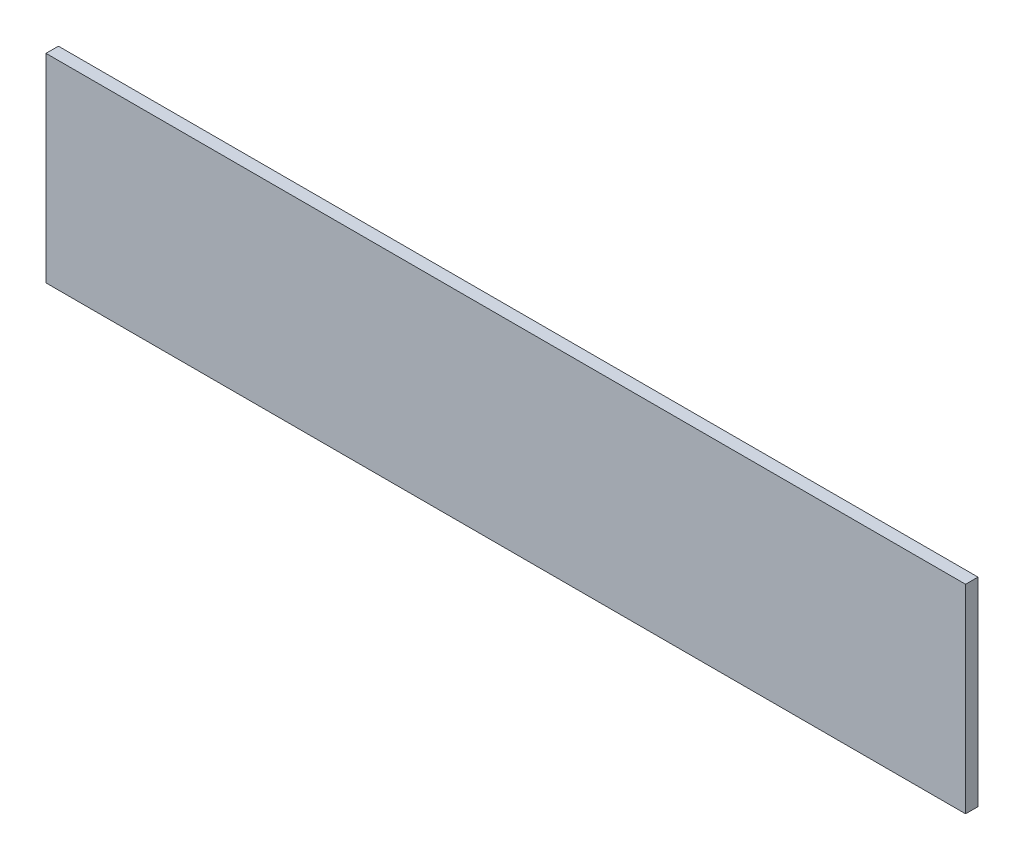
ISO-10303-21;
HEADER;
FILE_DESCRIPTION(('STEP AP214'),'2;1');
FILE_NAME('part.step','',(''),(''),'','','');
FILE_SCHEMA(('AUTOMOTIVE_DESIGN { 1 0 10303 214 1 1 1 1 }'));
ENDSEC;
DATA;
#1=APPLICATION_CONTEXT('core data for automotive mechanical design processes');
#2=APPLICATION_PROTOCOL_DEFINITION('international standard','automotive_design',2000,#1);
#3=PRODUCT_CONTEXT('',#1,'mechanical');
#4=PRODUCT('Part','Part','',(#3));
#5=PRODUCT_RELATED_PRODUCT_CATEGORY('part','',(#4));
#6=PRODUCT_DEFINITION_FORMATION('','',#4);
#7=PRODUCT_DEFINITION_CONTEXT('part definition',#1,'design');
#8=PRODUCT_DEFINITION('design','',#6,#7);
#9=PRODUCT_DEFINITION_SHAPE('','',#8);
#10=(LENGTH_UNIT() NAMED_UNIT(*) SI_UNIT(.MILLI.,.METRE.));
#11=(NAMED_UNIT(*) PLANE_ANGLE_UNIT() SI_UNIT($,.RADIAN.));
#12=(NAMED_UNIT(*) SI_UNIT($,.STERADIAN.) SOLID_ANGLE_UNIT());
#13=UNCERTAINTY_MEASURE_WITH_UNIT(LENGTH_MEASURE(1.E-05),#10,'distance_accuracy_value','');
#14=(GEOMETRIC_REPRESENTATION_CONTEXT(3) GLOBAL_UNCERTAINTY_ASSIGNED_CONTEXT((#13)) GLOBAL_UNIT_ASSIGNED_CONTEXT((#10,
#11,#12)) REPRESENTATION_CONTEXT('',''));
#15=CARTESIAN_POINT('',(0.,0.,0.));
#16=DIRECTION('',(0.,0.,1.));
#17=DIRECTION('',(1.,0.,0.));
#18=AXIS2_PLACEMENT_3D('',#15,#16,#17);
#19=CARTESIAN_POINT('',(0.,0.,5.));
#20=DIRECTION('',(1.,0.,0.));
#21=DIRECTION('',(0.,0.,-1.));
#22=AXIS2_PLACEMENT_3D('',#19,#20,#21);
#23=PLANE('',#22);
#24=DIRECTION('',(0.,-1.,0.));
#25=VECTOR('',#24,1.);
#26=CARTESIAN_POINT('',(0.,0.,0.));
#27=LINE('',#26,#25);
#28=CARTESIAN_POINT('',(0.,80.,0.));
#29=VERTEX_POINT('',#28);
#30=CARTESIAN_POINT('',(0.,0.,0.));
#31=VERTEX_POINT('',#30);
#32=EDGE_CURVE('E113',#29,#31,#27,.T.);
#33=ORIENTED_EDGE('',*,*,#32,.T.);
#34=DIRECTION('',(0.,0.,-1.));
#35=VECTOR('',#34,1.);
#36=CARTESIAN_POINT('',(0.,0.,5.));
#37=LINE('',#36,#35);
#38=CARTESIAN_POINT('',(0.,0.,5.));
#39=VERTEX_POINT('',#38);
#40=EDGE_CURVE('E11',#39,#31,#37,.T.);
#41=ORIENTED_EDGE('',*,*,#40,.F.);
#42=DIRECTION('',(0.,-1.,0.));
#43=VECTOR('',#42,1.);
#44=CARTESIAN_POINT('',(0.,0.,5.));
#45=LINE('',#44,#43);
#46=CARTESIAN_POINT('',(0.,80.,5.));
#47=VERTEX_POINT('',#46);
#48=EDGE_CURVE('E97',#47,#39,#45,.T.);
#49=ORIENTED_EDGE('',*,*,#48,.F.);
#50=DIRECTION('',(0.,0.,-1.));
#51=VECTOR('',#50,1.);
#52=CARTESIAN_POINT('',(0.,80.,5.));
#53=LINE('',#52,#51);
#54=EDGE_CURVE('E109',#47,#29,#53,.T.);
#55=ORIENTED_EDGE('',*,*,#54,.T.);
#56=EDGE_LOOP('',(#33,#41,#49,#55));
#57=FACE_BOUND('',#56,.T.);
#58=ADVANCED_FACE('F45',(#57),#23,.F.);
#59=CARTESIAN_POINT('',(0.,0.,5.));
#60=DIRECTION('',(0.,1.,0.));
#61=DIRECTION('',(0.,0.,1.));
#62=AXIS2_PLACEMENT_3D('',#59,#60,#61);
#63=PLANE('',#62);
#64=DIRECTION('',(1.,0.,0.));
#65=VECTOR('',#64,1.);
#66=CARTESIAN_POINT('',(0.,0.,0.));
#67=LINE('',#66,#65);
#68=CARTESIAN_POINT('',(370.,0.,0.));
#69=VERTEX_POINT('',#68);
#70=EDGE_CURVE('E102',#31,#69,#67,.T.);
#71=ORIENTED_EDGE('',*,*,#70,.T.);
#72=DIRECTION('',(0.,0.,-1.));
#73=VECTOR('',#72,1.);
#74=CARTESIAN_POINT('',(370.,0.,5.));
#75=LINE('',#74,#73);
#76=CARTESIAN_POINT('',(370.,0.,5.));
#77=VERTEX_POINT('',#76);
#78=EDGE_CURVE('E54',#77,#69,#75,.T.);
#79=ORIENTED_EDGE('',*,*,#78,.F.);
#80=DIRECTION('',(1.,0.,0.));
#81=VECTOR('',#80,1.);
#82=CARTESIAN_POINT('',(0.,0.,5.));
#83=LINE('',#82,#81);
#84=EDGE_CURVE('E92',#39,#77,#83,.T.);
#85=ORIENTED_EDGE('',*,*,#84,.F.);
#86=ORIENTED_EDGE('',*,*,#40,.T.);
#87=EDGE_LOOP('',(#71,#79,#85,#86));
#88=FACE_BOUND('',#87,.T.);
#89=ADVANCED_FACE('F101',(#88),#63,.F.);
#90=CARTESIAN_POINT('',(370.,0.,5.));
#91=DIRECTION('',(-1.,0.,0.));
#92=DIRECTION('',(0.,0.,1.));
#93=AXIS2_PLACEMENT_3D('',#90,#91,#92);
#94=PLANE('',#93);
#95=DIRECTION('',(0.,1.,0.));
#96=VECTOR('',#95,1.);
#97=CARTESIAN_POINT('',(370.,0.,0.));
#98=LINE('',#97,#96);
#99=CARTESIAN_POINT('',(370.,80.,0.));
#100=VERTEX_POINT('',#99);
#101=EDGE_CURVE('E79',#69,#100,#98,.T.);
#102=ORIENTED_EDGE('',*,*,#101,.T.);
#103=DIRECTION('',(0.,0.,-1.));
#104=VECTOR('',#103,1.);
#105=CARTESIAN_POINT('',(370.,80.,5.));
#106=LINE('',#105,#104);
#107=CARTESIAN_POINT('',(370.,80.,5.));
#108=VERTEX_POINT('',#107);
#109=EDGE_CURVE('E104',#108,#100,#106,.T.);
#110=ORIENTED_EDGE('',*,*,#109,.F.);
#111=DIRECTION('',(0.,1.,0.));
#112=VECTOR('',#111,1.);
#113=CARTESIAN_POINT('',(370.,0.,5.));
#114=LINE('',#113,#112);
#115=EDGE_CURVE('E95',#77,#108,#114,.T.);
#116=ORIENTED_EDGE('',*,*,#115,.F.);
#117=ORIENTED_EDGE('',*,*,#78,.T.);
#118=EDGE_LOOP('',(#102,#110,#116,#117));
#119=FACE_BOUND('',#118,.T.);
#120=ADVANCED_FACE('F105',(#119),#94,.F.);
#121=CARTESIAN_POINT('',(0.,80.,5.));
#122=DIRECTION('',(0.,-1.,0.));
#123=DIRECTION('',(0.,0.,-1.));
#124=AXIS2_PLACEMENT_3D('',#121,#122,#123);
#125=PLANE('',#124);
#126=DIRECTION('',(-1.,0.,0.));
#127=VECTOR('',#126,1.);
#128=CARTESIAN_POINT('',(0.,80.,0.));
#129=LINE('',#128,#127);
#130=EDGE_CURVE('E85',#100,#29,#129,.T.);
#131=ORIENTED_EDGE('',*,*,#130,.T.);
#132=ORIENTED_EDGE('',*,*,#54,.F.);
#133=DIRECTION('',(-1.,0.,0.));
#134=VECTOR('',#133,1.);
#135=CARTESIAN_POINT('',(0.,80.,5.));
#136=LINE('',#135,#134);
#137=EDGE_CURVE('E62',#108,#47,#136,.T.);
#138=ORIENTED_EDGE('',*,*,#137,.F.);
#139=ORIENTED_EDGE('',*,*,#109,.T.);
#140=EDGE_LOOP('',(#131,#132,#138,#139));
#141=FACE_BOUND('',#140,.T.);
#142=ADVANCED_FACE('F126',(#141),#125,.F.);
#143=CARTESIAN_POINT('',(0.,0.,5.));
#144=DIRECTION('',(0.,0.,-1.));
#145=DIRECTION('',(-1.,0.,0.));
#146=AXIS2_PLACEMENT_3D('',#143,#144,#145);
#147=PLANE('',#146);
#148=ORIENTED_EDGE('',*,*,#48,.T.);
#149=ORIENTED_EDGE('',*,*,#84,.T.);
#150=ORIENTED_EDGE('',*,*,#115,.T.);
#151=ORIENTED_EDGE('',*,*,#137,.T.);
#152=EDGE_LOOP('',(#148,#149,#150,#151));
#153=FACE_BOUND('',#152,.T.);
#154=ADVANCED_FACE('F93',(#153),#147,.F.);
#155=CARTESIAN_POINT('',(0.,0.,0.));
#156=DIRECTION('',(0.,0.,-1.));
#157=DIRECTION('',(-1.,0.,0.));
#158=AXIS2_PLACEMENT_3D('',#155,#156,#157);
#159=PLANE('',#158);
#160=ORIENTED_EDGE('',*,*,#32,.F.);
#161=ORIENTED_EDGE('',*,*,#130,.F.);
#162=ORIENTED_EDGE('',*,*,#101,.F.);
#163=ORIENTED_EDGE('',*,*,#70,.F.);
#164=EDGE_LOOP('',(#160,#161,#162,#163));
#165=FACE_BOUND('',#164,.T.);
#166=ADVANCED_FACE('F129',(#165),#159,.T.);
#167=CLOSED_SHELL('',(#58,#89,#120,#142,#154,#166));
#168=MANIFOLD_SOLID_BREP('B2',#167);
#169=ADVANCED_BREP_SHAPE_REPRESENTATION('',(#18,#168),#14);
#170=SHAPE_DEFINITION_REPRESENTATION(#9,#169);
ENDSEC;
END-ISO-10303-21;
